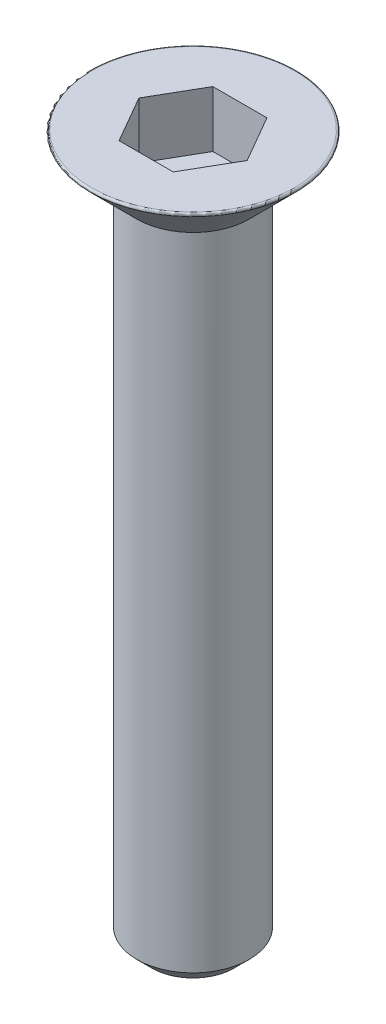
ISO-10303-21;
HEADER;
FILE_DESCRIPTION(('STEP AP214'),'2;1');
FILE_NAME('part.step','',(''),(''),'','','');
FILE_SCHEMA(('AUTOMOTIVE_DESIGN { 1 0 10303 214 1 1 1 1 }'));
ENDSEC;
DATA;
#1=APPLICATION_CONTEXT('core data for automotive mechanical design processes');
#2=APPLICATION_PROTOCOL_DEFINITION('international standard','automotive_design',2000,#1);
#3=PRODUCT_CONTEXT('',#1,'mechanical');
#4=PRODUCT('Part','Part','',(#3));
#5=PRODUCT_RELATED_PRODUCT_CATEGORY('part','',(#4));
#6=PRODUCT_DEFINITION_FORMATION('','',#4);
#7=PRODUCT_DEFINITION_CONTEXT('part definition',#1,'design');
#8=PRODUCT_DEFINITION('design','',#6,#7);
#9=PRODUCT_DEFINITION_SHAPE('','',#8);
#10=(LENGTH_UNIT() NAMED_UNIT(*) SI_UNIT(.MILLI.,.METRE.));
#11=(NAMED_UNIT(*) PLANE_ANGLE_UNIT() SI_UNIT($,.RADIAN.));
#12=(NAMED_UNIT(*) SI_UNIT($,.STERADIAN.) SOLID_ANGLE_UNIT());
#13=UNCERTAINTY_MEASURE_WITH_UNIT(LENGTH_MEASURE(1.E-05),#10,'distance_accuracy_value','');
#14=(GEOMETRIC_REPRESENTATION_CONTEXT(3) GLOBAL_UNCERTAINTY_ASSIGNED_CONTEXT((#13)) GLOBAL_UNIT_ASSIGNED_CONTEXT((#10,
#11,#12)) REPRESENTATION_CONTEXT('',''));
#15=CARTESIAN_POINT('',(0.,0.,0.));
#16=DIRECTION('',(0.,0.,1.));
#17=DIRECTION('',(1.,0.,0.));
#18=AXIS2_PLACEMENT_3D('',#15,#16,#17);
#19=CARTESIAN_POINT('',(0.,0.,0.));
#20=DIRECTION('',(0.,1.,0.));
#21=DIRECTION('',(0.,0.,1.));
#22=AXIS2_PLACEMENT_3D('',#19,#20,#21);
#23=PLANE('',#22);
#24=DIRECTION('',(0.5,0.,-0.866025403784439));
#25=VECTOR('',#24,1.);
#26=CARTESIAN_POINT('',(1.44337567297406,0.,2.5));
#27=LINE('',#26,#25);
#28=CARTESIAN_POINT('',(1.44337567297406,0.,2.5));
#29=VERTEX_POINT('',#28);
#30=CARTESIAN_POINT('',(2.88675134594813,0.,0.));
#31=VERTEX_POINT('',#30);
#32=EDGE_CURVE('E48',#29,#31,#27,.T.);
#33=ORIENTED_EDGE('',*,*,#32,.F.);
#34=DIRECTION('',(1.,0.,0.));
#35=VECTOR('',#34,1.);
#36=CARTESIAN_POINT('',(-1.44337567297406,0.,2.5));
#37=LINE('',#36,#35);
#38=CARTESIAN_POINT('',(-1.44337567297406,0.,2.5));
#39=VERTEX_POINT('',#38);
#40=EDGE_CURVE('E131',#39,#29,#37,.T.);
#41=ORIENTED_EDGE('',*,*,#40,.F.);
#42=DIRECTION('',(0.5,0.,0.866025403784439));
#43=VECTOR('',#42,1.);
#44=CARTESIAN_POINT('',(-2.88675134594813,0.,0.));
#45=LINE('',#44,#43);
#46=CARTESIAN_POINT('',(-2.88675134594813,0.,0.));
#47=VERTEX_POINT('',#46);
#48=EDGE_CURVE('E129',#47,#39,#45,.T.);
#49=ORIENTED_EDGE('',*,*,#48,.F.);
#50=DIRECTION('',(-0.5,0.,0.866025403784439));
#51=VECTOR('',#50,1.);
#52=CARTESIAN_POINT('',(-1.44337567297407,0.,-2.5));
#53=LINE('',#52,#51);
#54=CARTESIAN_POINT('',(-1.44337567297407,0.,-2.5));
#55=VERTEX_POINT('',#54);
#56=EDGE_CURVE('E96',#55,#47,#53,.T.);
#57=ORIENTED_EDGE('',*,*,#56,.F.);
#58=DIRECTION('',(-1.,0.,0.));
#59=VECTOR('',#58,1.);
#60=CARTESIAN_POINT('',(1.44337567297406,0.,-2.5));
#61=LINE('',#60,#59);
#62=CARTESIAN_POINT('',(1.44337567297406,0.,-2.5));
#63=VERTEX_POINT('',#62);
#64=EDGE_CURVE('E125',#63,#55,#61,.T.);
#65=ORIENTED_EDGE('',*,*,#64,.F.);
#66=DIRECTION('',(-0.5,0.,-0.866025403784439));
#67=VECTOR('',#66,1.);
#68=CARTESIAN_POINT('',(2.88675134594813,0.,0.));
#69=LINE('',#68,#67);
#70=EDGE_CURVE('E122',#31,#63,#69,.T.);
#71=ORIENTED_EDGE('',*,*,#70,.F.);
#72=EDGE_LOOP('',(#33,#41,#49,#57,#65,#71));
#73=FACE_BOUND('',#72,.T.);
#74=CARTESIAN_POINT('',(0.,0.,0.));
#75=DIRECTION('',(0.,1.,0.));
#76=DIRECTION('',(0.,0.,1.));
#77=AXIS2_PLACEMENT_3D('',#74,#75,#76);
#78=CIRCLE('',#77,5.40857864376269);
#79=CARTESIAN_POINT('',(0.,0.,5.40857864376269));
#80=VERTEX_POINT('',#79);
#81=EDGE_CURVE('E143',#80,#80,#78,.T.);
#82=ORIENTED_EDGE('',*,*,#81,.T.);
#83=EDGE_LOOP('',(#82));
#84=FACE_BOUND('',#83,.T.);
#85=ADVANCED_FACE('F33',(#73,#84),#23,.T.);
#86=CARTESIAN_POINT('',(0.,0.,0.));
#87=DIRECTION('',(0.,1.,0.));
#88=DIRECTION('',(0.,0.,1.));
#89=AXIS2_PLACEMENT_3D('',#86,#87,#88);
#90=CONICAL_SURFACE('',#89,5.65,0.78539816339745);
#91=CARTESIAN_POINT('',(0.,-0.170710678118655,0.));
#92=DIRECTION('',(0.,-1.,0.));
#93=DIRECTION('',(0.,0.,-1.));
#94=AXIS2_PLACEMENT_3D('',#91,#92,#93);
#95=CIRCLE('',#94,5.47928932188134);
#96=CARTESIAN_POINT('',(0.,-0.170710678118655,-5.47928932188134));
#97=VERTEX_POINT('',#96);
#98=EDGE_CURVE('E146',#97,#97,#95,.T.);
#99=ORIENTED_EDGE('',*,*,#98,.T.);
#100=EDGE_LOOP('',(#99));
#101=FACE_BOUND('',#100,.T.);
#102=CARTESIAN_POINT('',(0.,-2.64999999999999,0.));
#103=DIRECTION('',(0.,1.,0.));
#104=DIRECTION('',(0.,0.,1.));
#105=AXIS2_PLACEMENT_3D('',#102,#103,#104);
#106=CIRCLE('',#105,3.);
#107=CARTESIAN_POINT('',(0.,-2.64999999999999,3.));
#108=VERTEX_POINT('',#107);
#109=EDGE_CURVE('E135',#108,#108,#106,.T.);
#110=ORIENTED_EDGE('',*,*,#109,.T.);
#111=EDGE_LOOP('',(#110));
#112=FACE_BOUND('',#111,.T.);
#113=ADVANCED_FACE('F168',(#101,#112),#90,.T.);
#114=CARTESIAN_POINT('',(0.,15.4879719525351,0.));
#115=DIRECTION('',(0.,1.,0.));
#116=DIRECTION('',(0.,0.,1.));
#117=AXIS2_PLACEMENT_3D('',#114,#115,#116);
#118=CYLINDRICAL_SURFACE('',#117,3.);
#119=CARTESIAN_POINT('',(0.,-36.85,0.));
#120=DIRECTION('',(0.,-1.,0.));
#121=DIRECTION('',(0.,0.,-1.));
#122=AXIS2_PLACEMENT_3D('',#119,#120,#121);
#123=CIRCLE('',#122,3.);
#124=CARTESIAN_POINT('',(0.,-36.85,-3.));
#125=VERTEX_POINT('',#124);
#126=EDGE_CURVE('E41',#125,#125,#123,.F.);
#127=ORIENTED_EDGE('',*,*,#126,.T.);
#128=EDGE_LOOP('',(#127));
#129=FACE_BOUND('',#128,.T.);
#130=ORIENTED_EDGE('',*,*,#109,.F.);
#131=EDGE_LOOP('',(#130));
#132=FACE_BOUND('',#131,.T.);
#133=ADVANCED_FACE('F151',(#129,#132),#118,.T.);
#134=CARTESIAN_POINT('',(2.99999999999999,-37.65,0.));
#135=DIRECTION('',(0.,-1.,0.));
#136=DIRECTION('',(0.,0.,-1.));
#137=AXIS2_PLACEMENT_3D('',#134,#135,#136);
#138=PLANE('',#137);
#139=CARTESIAN_POINT('',(0.,-37.65,0.));
#140=DIRECTION('',(0.,-1.,0.));
#141=DIRECTION('',(0.,0.,-1.));
#142=AXIS2_PLACEMENT_3D('',#139,#140,#141);
#143=CIRCLE('',#142,2.2);
#144=CARTESIAN_POINT('',(0.,-37.65,-2.2));
#145=VERTEX_POINT('',#144);
#146=EDGE_CURVE('E11',#145,#145,#143,.T.);
#147=ORIENTED_EDGE('',*,*,#146,.T.);
#148=EDGE_LOOP('',(#147));
#149=FACE_BOUND('',#148,.T.);
#150=ADVANCED_FACE('F164',(#149),#138,.T.);
#151=CARTESIAN_POINT('',(0.,-0.1,0.));
#152=DIRECTION('',(0.,1.,0.));
#153=DIRECTION('',(0.,0.,1.));
#154=AXIS2_PLACEMENT_3D('',#151,#152,#153);
#155=TOROIDAL_SURFACE('',#154,5.40857864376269,0.1);
#156=ORIENTED_EDGE('',*,*,#98,.F.);
#157=EDGE_LOOP('',(#156));
#158=FACE_BOUND('',#157,.T.);
#159=ORIENTED_EDGE('',*,*,#81,.F.);
#160=EDGE_LOOP('',(#159));
#161=FACE_BOUND('',#160,.T.);
#162=ADVANCED_FACE('F156',(#158,#161),#155,.T.);
#163=CARTESIAN_POINT('',(0.,-36.85,0.));
#164=DIRECTION('',(0.,1.,0.));
#165=DIRECTION('',(0.,0.,1.));
#166=AXIS2_PLACEMENT_3D('',#163,#164,#165);
#167=CONICAL_SURFACE('',#166,3.,0.78539816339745);
#168=ORIENTED_EDGE('',*,*,#146,.F.);
#169=EDGE_LOOP('',(#168));
#170=FACE_BOUND('',#169,.T.);
#171=ORIENTED_EDGE('',*,*,#126,.F.);
#172=EDGE_LOOP('',(#171));
#173=FACE_BOUND('',#172,.T.);
#174=ADVANCED_FACE('F35',(#170,#173),#167,.T.);
#175=CARTESIAN_POINT('',(1.44337567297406,-3.,2.5));
#176=DIRECTION('',(0.866025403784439,0.,0.5));
#177=DIRECTION('',(0.5,0.,-0.866025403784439));
#178=AXIS2_PLACEMENT_3D('',#175,#176,#177);
#179=PLANE('',#178);
#180=ORIENTED_EDGE('',*,*,#32,.T.);
#181=DIRECTION('',(0.,1.,0.));
#182=VECTOR('',#181,1.);
#183=CARTESIAN_POINT('',(2.88675134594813,-3.,0.));
#184=LINE('',#183,#182);
#185=CARTESIAN_POINT('',(2.88675134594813,-3.,0.));
#186=VERTEX_POINT('',#185);
#187=EDGE_CURVE('E78',#186,#31,#184,.T.);
#188=ORIENTED_EDGE('',*,*,#187,.F.);
#189=DIRECTION('',(0.5,0.,-0.866025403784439));
#190=VECTOR('',#189,1.);
#191=CARTESIAN_POINT('',(1.44337567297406,-3.,2.5));
#192=LINE('',#191,#190);
#193=CARTESIAN_POINT('',(1.44337567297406,-3.,2.5));
#194=VERTEX_POINT('',#193);
#195=EDGE_CURVE('E133',#194,#186,#192,.T.);
#196=ORIENTED_EDGE('',*,*,#195,.F.);
#197=DIRECTION('',(0.,1.,0.));
#198=VECTOR('',#197,1.);
#199=CARTESIAN_POINT('',(1.44337567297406,-3.,2.5));
#200=LINE('',#199,#198);
#201=EDGE_CURVE('E56',#194,#29,#200,.T.);
#202=ORIENTED_EDGE('',*,*,#201,.T.);
#203=EDGE_LOOP('',(#180,#188,#196,#202));
#204=FACE_BOUND('',#203,.T.);
#205=ADVANCED_FACE('F155',(#204),#179,.F.);
#206=CARTESIAN_POINT('',(-1.44337567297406,-3.,2.5));
#207=DIRECTION('',(0.,0.,1.));
#208=DIRECTION('',(1.,0.,0.));
#209=AXIS2_PLACEMENT_3D('',#206,#207,#208);
#210=PLANE('',#209);
#211=ORIENTED_EDGE('',*,*,#40,.T.);
#212=ORIENTED_EDGE('',*,*,#201,.F.);
#213=DIRECTION('',(1.,0.,0.));
#214=VECTOR('',#213,1.);
#215=CARTESIAN_POINT('',(-1.44337567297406,-3.,2.5));
#216=LINE('',#215,#214);
#217=CARTESIAN_POINT('',(-1.44337567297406,-3.,2.5));
#218=VERTEX_POINT('',#217);
#219=EDGE_CURVE('E108',#218,#194,#216,.T.);
#220=ORIENTED_EDGE('',*,*,#219,.F.);
#221=DIRECTION('',(0.,1.,0.));
#222=VECTOR('',#221,1.);
#223=CARTESIAN_POINT('',(-1.44337567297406,-3.,2.5));
#224=LINE('',#223,#222);
#225=EDGE_CURVE('E100',#218,#39,#224,.T.);
#226=ORIENTED_EDGE('',*,*,#225,.T.);
#227=EDGE_LOOP('',(#211,#212,#220,#226));
#228=FACE_BOUND('',#227,.T.);
#229=ADVANCED_FACE('F162',(#228),#210,.F.);
#230=CARTESIAN_POINT('',(-2.88675134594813,-3.,0.));
#231=DIRECTION('',(-0.866025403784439,0.,0.5));
#232=DIRECTION('',(0.5,0.,0.866025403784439));
#233=AXIS2_PLACEMENT_3D('',#230,#231,#232);
#234=PLANE('',#233);
#235=ORIENTED_EDGE('',*,*,#48,.T.);
#236=ORIENTED_EDGE('',*,*,#225,.F.);
#237=DIRECTION('',(0.5,0.,0.866025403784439));
#238=VECTOR('',#237,1.);
#239=CARTESIAN_POINT('',(-2.88675134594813,-3.,0.));
#240=LINE('',#239,#238);
#241=CARTESIAN_POINT('',(-2.88675134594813,-3.,0.));
#242=VERTEX_POINT('',#241);
#243=EDGE_CURVE('E104',#242,#218,#240,.T.);
#244=ORIENTED_EDGE('',*,*,#243,.F.);
#245=DIRECTION('',(0.,1.,0.));
#246=VECTOR('',#245,1.);
#247=CARTESIAN_POINT('',(-2.88675134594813,-3.,0.));
#248=LINE('',#247,#246);
#249=EDGE_CURVE('E89',#242,#47,#248,.T.);
#250=ORIENTED_EDGE('',*,*,#249,.T.);
#251=EDGE_LOOP('',(#235,#236,#244,#250));
#252=FACE_BOUND('',#251,.T.);
#253=ADVANCED_FACE('F105',(#252),#234,.F.);
#254=CARTESIAN_POINT('',(-1.44337567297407,-3.,-2.5));
#255=DIRECTION('',(-0.866025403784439,0.,-0.5));
#256=DIRECTION('',(-0.5,0.,0.866025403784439));
#257=AXIS2_PLACEMENT_3D('',#254,#255,#256);
#258=PLANE('',#257);
#259=ORIENTED_EDGE('',*,*,#56,.T.);
#260=ORIENTED_EDGE('',*,*,#249,.F.);
#261=DIRECTION('',(-0.5,0.,0.866025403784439));
#262=VECTOR('',#261,1.);
#263=CARTESIAN_POINT('',(-1.44337567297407,-3.,-2.5));
#264=LINE('',#263,#262);
#265=CARTESIAN_POINT('',(-1.44337567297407,-3.,-2.5));
#266=VERTEX_POINT('',#265);
#267=EDGE_CURVE('E93',#266,#242,#264,.T.);
#268=ORIENTED_EDGE('',*,*,#267,.F.);
#269=DIRECTION('',(0.,1.,0.));
#270=VECTOR('',#269,1.);
#271=CARTESIAN_POINT('',(-1.44337567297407,-3.,-2.5));
#272=LINE('',#271,#270);
#273=EDGE_CURVE('E101',#266,#55,#272,.T.);
#274=ORIENTED_EDGE('',*,*,#273,.T.);
#275=EDGE_LOOP('',(#259,#260,#268,#274));
#276=FACE_BOUND('',#275,.T.);
#277=ADVANCED_FACE('F91',(#276),#258,.F.);
#278=CARTESIAN_POINT('',(1.44337567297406,-3.,-2.5));
#279=DIRECTION('',(0.,0.,-1.));
#280=DIRECTION('',(-1.,0.,0.));
#281=AXIS2_PLACEMENT_3D('',#278,#279,#280);
#282=PLANE('',#281);
#283=ORIENTED_EDGE('',*,*,#64,.T.);
#284=ORIENTED_EDGE('',*,*,#273,.F.);
#285=DIRECTION('',(-1.,0.,0.));
#286=VECTOR('',#285,1.);
#287=CARTESIAN_POINT('',(1.44337567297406,-3.,-2.5));
#288=LINE('',#287,#286);
#289=CARTESIAN_POINT('',(1.44337567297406,-3.,-2.5));
#290=VERTEX_POINT('',#289);
#291=EDGE_CURVE('E114',#290,#266,#288,.T.);
#292=ORIENTED_EDGE('',*,*,#291,.F.);
#293=DIRECTION('',(0.,1.,0.));
#294=VECTOR('',#293,1.);
#295=CARTESIAN_POINT('',(1.44337567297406,-3.,-2.5));
#296=LINE('',#295,#294);
#297=EDGE_CURVE('E138',#290,#63,#296,.T.);
#298=ORIENTED_EDGE('',*,*,#297,.T.);
#299=EDGE_LOOP('',(#283,#284,#292,#298));
#300=FACE_BOUND('',#299,.T.);
#301=ADVANCED_FACE('F186',(#300),#282,.F.);
#302=CARTESIAN_POINT('',(2.88675134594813,-3.,0.));
#303=DIRECTION('',(0.866025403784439,0.,-0.5));
#304=DIRECTION('',(-0.5,0.,-0.866025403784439));
#305=AXIS2_PLACEMENT_3D('',#302,#303,#304);
#306=PLANE('',#305);
#307=ORIENTED_EDGE('',*,*,#70,.T.);
#308=ORIENTED_EDGE('',*,*,#297,.F.);
#309=DIRECTION('',(-0.5,0.,-0.866025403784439));
#310=VECTOR('',#309,1.);
#311=CARTESIAN_POINT('',(2.88675134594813,-3.,0.));
#312=LINE('',#311,#310);
#313=EDGE_CURVE('E116',#186,#290,#312,.T.);
#314=ORIENTED_EDGE('',*,*,#313,.F.);
#315=ORIENTED_EDGE('',*,*,#187,.T.);
#316=EDGE_LOOP('',(#307,#308,#314,#315));
#317=FACE_BOUND('',#316,.T.);
#318=ADVANCED_FACE('F183',(#317),#306,.F.);
#319=CARTESIAN_POINT('',(2.88675134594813,-3.,0.));
#320=DIRECTION('',(0.,1.,0.));
#321=DIRECTION('',(0.,0.,1.));
#322=AXIS2_PLACEMENT_3D('',#319,#320,#321);
#323=PLANE('',#322);
#324=ORIENTED_EDGE('',*,*,#195,.T.);
#325=ORIENTED_EDGE('',*,*,#313,.T.);
#326=ORIENTED_EDGE('',*,*,#291,.T.);
#327=ORIENTED_EDGE('',*,*,#267,.T.);
#328=ORIENTED_EDGE('',*,*,#243,.T.);
#329=ORIENTED_EDGE('',*,*,#219,.T.);
#330=EDGE_LOOP('',(#324,#325,#326,#327,#328,#329));
#331=FACE_BOUND('',#330,.T.);
#332=ADVANCED_FACE('F111',(#331),#323,.T.);
#333=CLOSED_SHELL('',(#85,#113,#133,#150,#162,#174,#205,#229,#253,#277,#301,#318,#332));
#334=MANIFOLD_SOLID_BREP('B2',#333);
#335=ADVANCED_BREP_SHAPE_REPRESENTATION('',(#18,#334),#14);
#336=SHAPE_DEFINITION_REPRESENTATION(#9,#335);
ENDSEC;
END-ISO-10303-21;
